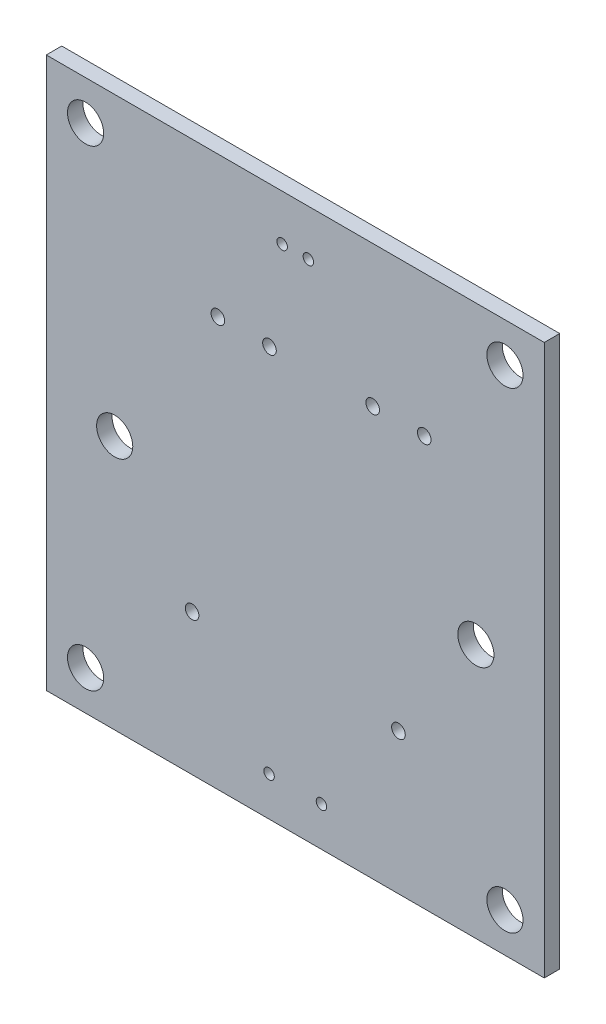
from build123d import *

# Parameters (mm, degrees)
SKETCH1_W           = 48.26
SKETCH1_H           = 53.34
BOSS_EXTRUDE1_DEPTH = 1.4986
SKETCH2_R           = 1.7526
SKETCH2_R_2         = 0.508
SKETCH2_R_3         = 0.6604
CUT_EXTRUDE1_DEPTH  = 1.4986


with BuildPart() as part:
    # Sketch1 → Boss-Extrude1 (new body)
    with BuildSketch(Plane.XY):
        with Locations((24.13, -26.67)):
            Rectangle(SKETCH1_W, SKETCH1_H)
    extrude(amount=BOSS_EXTRUDE1_DEPTH)

    # Sketch2 → Cut-Extrude1 (cut)
    with BuildSketch(Plane.XY.offset(1.4986)):
        with Locations((3.81, -3.81)):
            Circle(SKETCH2_R)
        with Locations((44.45, -3.81)):
            Circle(SKETCH2_R)
        with Locations((44.45, -49.53)):
            Circle(SKETCH2_R)
        with Locations((3.81, -49.53)):
            Circle(SKETCH2_R)
        with Locations((21.59, -49.53)):
            Circle(SKETCH2_R_2)
        with Locations((26.67, -49.53)):
            Circle(SKETCH2_R_2)
        with Locations((22.86, -4.445)):
            Circle(SKETCH2_R_2)
        with Locations((25.4, -4.445)):
            Circle(SKETCH2_R_2)
        with Locations((16.62938, -13.67028)):
            Circle(SKETCH2_R_3)
        with Locations((21.63064, -13.67028)):
            Circle(SKETCH2_R_3)
        with Locations((31.63062, -13.67028)):
            Circle(SKETCH2_R_3)
        with Locations((36.62934, -13.67028)):
            Circle(SKETCH2_R_3)
        with Locations((14.13002, -39.66972)):
            Circle(SKETCH2_R_3)
        with Locations((34.12998, -39.66972)):
            Circle(SKETCH2_R_3)
        with Locations((6.6294, -28.66898)):
            Circle(SKETCH2_R)
        with Locations((41.6306, -28.66898)):
            Circle(SKETCH2_R)
    extrude(amount=-CUT_EXTRUDE1_DEPTH, mode=Mode.SUBTRACT)


solid = part.part
